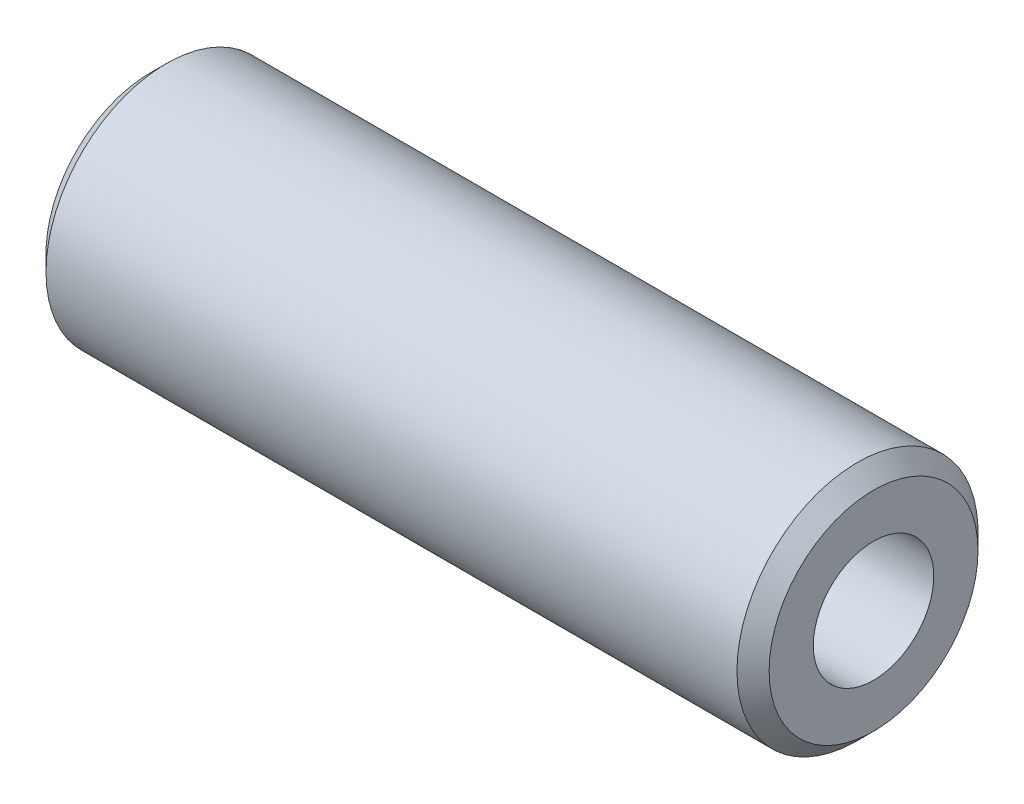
from build123d import *

# Parameters (mm, degrees)
SKETCH1_R           = 15
SKETCH1_R_2         = 7.5
BOSS_EXTRUDE1_DEPTH = 45
CHAMFER1_SIZE       = 2


with BuildPart() as part:
    # Sketch1 → Boss-Extrude1 (new, symmetric)
    with BuildSketch(Plane(origin=(0, 0, 0), x_dir=(0, 0, -1), z_dir=(1, 0, 0))):
        with Locations(Location((0, 0, 0), (0, 0, 180))):
            Circle(SKETCH1_R)
        with Locations(Location((0, 0, 0), (0, 0, 180))):
            Circle(SKETCH1_R_2, mode=Mode.SUBTRACT)
    extrude(amount=BOSS_EXTRUDE1_DEPTH, both=True)

    # Chamfer1
    chamfer1_edges = [part.edges().sort_by_distance(p)[0] for p in [
        (-45, 0, -15),
        (45, 0, -15),
    ]]
    chamfer(chamfer1_edges, length=CHAMFER1_SIZE)


solid = part.part
